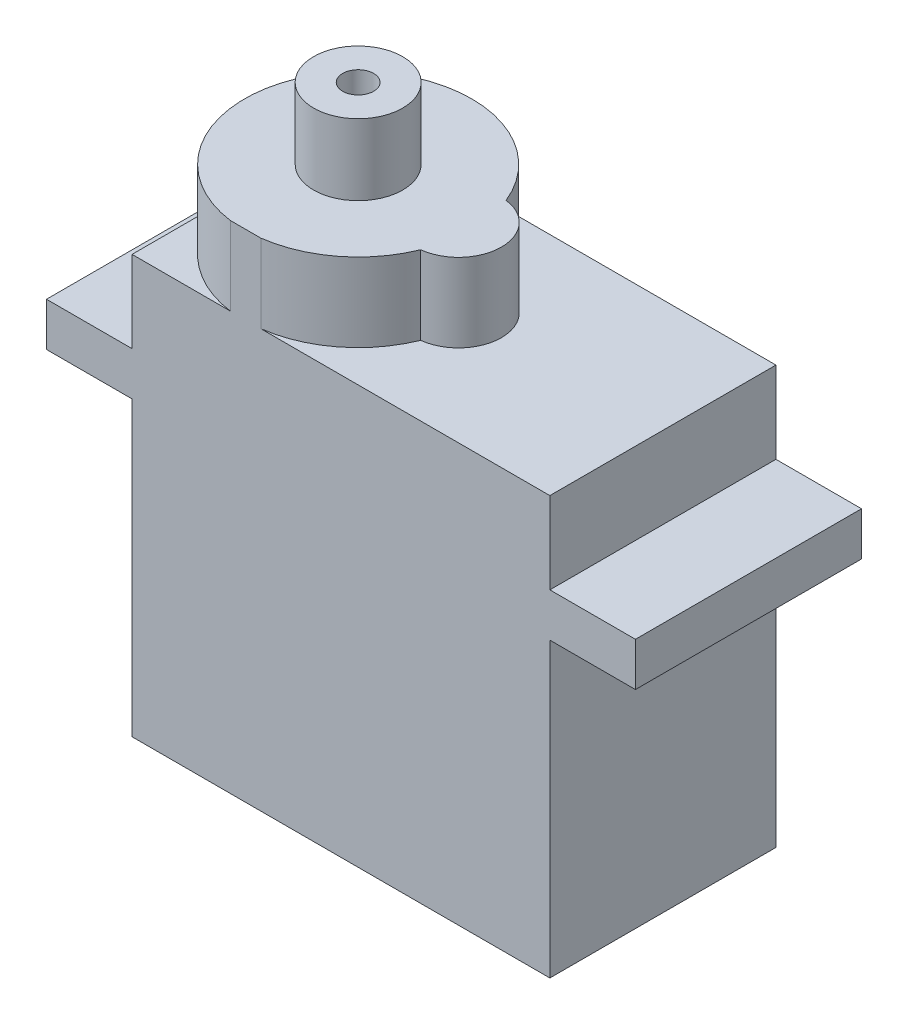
ISO-10303-21;
HEADER;
FILE_DESCRIPTION(('STEP AP214'),'2;1');
FILE_NAME('part.step','',(''),(''),'','','');
FILE_SCHEMA(('AUTOMOTIVE_DESIGN { 1 0 10303 214 1 1 1 1 }'));
ENDSEC;
DATA;
#1=APPLICATION_CONTEXT('core data for automotive mechanical design processes');
#2=APPLICATION_PROTOCOL_DEFINITION('international standard','automotive_design',2000,#1);
#3=PRODUCT_CONTEXT('',#1,'mechanical');
#4=PRODUCT('Part','Part','',(#3));
#5=PRODUCT_RELATED_PRODUCT_CATEGORY('part','',(#4));
#6=PRODUCT_DEFINITION_FORMATION('','',#4);
#7=PRODUCT_DEFINITION_CONTEXT('part definition',#1,'design');
#8=PRODUCT_DEFINITION('design','',#6,#7);
#9=PRODUCT_DEFINITION_SHAPE('','',#8);
#10=(LENGTH_UNIT() NAMED_UNIT(*) SI_UNIT(.MILLI.,.METRE.));
#11=(NAMED_UNIT(*) PLANE_ANGLE_UNIT() SI_UNIT($,.RADIAN.));
#12=(NAMED_UNIT(*) SI_UNIT($,.STERADIAN.) SOLID_ANGLE_UNIT());
#13=UNCERTAINTY_MEASURE_WITH_UNIT(LENGTH_MEASURE(1.E-05),#10,'distance_accuracy_value','');
#14=(GEOMETRIC_REPRESENTATION_CONTEXT(3) GLOBAL_UNCERTAINTY_ASSIGNED_CONTEXT((#13)) GLOBAL_UNIT_ASSIGNED_CONTEXT((#10,
#11,#12)) REPRESENTATION_CONTEXT('',''));
#15=CARTESIAN_POINT('',(0.,0.,0.));
#16=DIRECTION('',(0.,0.,1.));
#17=DIRECTION('',(1.,0.,0.));
#18=AXIS2_PLACEMENT_3D('',#15,#16,#17);
#19=CARTESIAN_POINT('',(-16.7886521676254,19.315529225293,12.1));
#20=DIRECTION('',(0.,-1.,0.));
#21=DIRECTION('',(0.,0.,-1.));
#22=AXIS2_PLACEMENT_3D('',#19,#20,#21);
#23=PLANE('',#22);
#24=CARTESIAN_POINT('',(-10.7113130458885,19.315529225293,6.07733912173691));
#25=DIRECTION('',(0.,1.,0.));
#26=DIRECTION('',(0.,0.,1.));
#27=AXIS2_PLACEMENT_3D('',#24,#25,#26);
#28=CIRCLE('',#27,6.07733912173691);
#29=CARTESIAN_POINT('',(-16.7886521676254,19.315529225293,6.07733912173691));
#30=VERTEX_POINT('',#29);
#31=CARTESIAN_POINT('',(-11.5247051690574,19.315529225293,12.1));
#32=VERTEX_POINT('',#31);
#33=EDGE_CURVE('E45',#30,#32,#28,.T.);
#34=ORIENTED_EDGE('',*,*,#33,.F.);
#35=DIRECTION('',(0.,0.,-1.));
#36=VECTOR('',#35,1.);
#37=CARTESIAN_POINT('',(-16.7886521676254,19.315529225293,12.1));
#38=LINE('',#37,#36);
#39=CARTESIAN_POINT('',(-16.7886521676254,19.315529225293,12.1));
#40=VERTEX_POINT('',#39);
#41=EDGE_CURVE('E265',#40,#30,#38,.T.);
#42=ORIENTED_EDGE('',*,*,#41,.F.);
#43=DIRECTION('',(-1.,0.,0.));
#44=VECTOR('',#43,1.);
#45=CARTESIAN_POINT('',(-16.7886521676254,19.315529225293,12.1));
#46=LINE('',#45,#44);
#47=EDGE_CURVE('E61',#32,#40,#46,.T.);
#48=ORIENTED_EDGE('',*,*,#47,.F.);
#49=EDGE_LOOP('',(#34,#42,#48));
#50=FACE_BOUND('',#49,.T.);
#51=ADVANCED_FACE('F36',(#50),#23,.F.);
#52=CARTESIAN_POINT('',(-10.7113130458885,19.315529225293,0.));
#53=VERTEX_POINT('',#52);
#54=EDGE_CURVE('E277',#53,#30,#28,.T.);
#55=ORIENTED_EDGE('',*,*,#54,.F.);
#56=DIRECTION('',(-1.,0.,0.));
#57=VECTOR('',#56,1.);
#58=CARTESIAN_POINT('',(-16.7886521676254,19.315529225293,0.));
#59=LINE('',#58,#57);
#60=CARTESIAN_POINT('',(-16.7886521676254,19.315529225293,0.));
#61=VERTEX_POINT('',#60);
#62=EDGE_CURVE('E262',#53,#61,#59,.T.);
#63=ORIENTED_EDGE('',*,*,#62,.T.);
#64=EDGE_CURVE('E254',#30,#61,#38,.T.);
#65=ORIENTED_EDGE('',*,*,#64,.F.);
#66=EDGE_LOOP('',(#55,#63,#65));
#67=FACE_BOUND('',#66,.T.);
#68=ADVANCED_FACE('F318',(#67),#23,.F.);
#69=CARTESIAN_POINT('',(-16.7886521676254,19.315529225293,12.1));
#70=DIRECTION('',(1.,0.,0.));
#71=DIRECTION('',(0.,1.,0.));
#72=AXIS2_PLACEMENT_3D('',#69,#70,#71);
#73=PLANE('',#72);
#74=DIRECTION('',(0.,0.,-1.));
#75=VECTOR('',#74,1.);
#76=CARTESIAN_POINT('',(-16.7886521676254,14.945529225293,0.));
#77=LINE('',#76,#75);
#78=CARTESIAN_POINT('',(-16.7886521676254,14.945529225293,12.1));
#79=VERTEX_POINT('',#78);
#80=CARTESIAN_POINT('',(-16.7886521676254,14.945529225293,0.));
#81=VERTEX_POINT('',#80);
#82=EDGE_CURVE('E187',#79,#81,#77,.T.);
#83=ORIENTED_EDGE('',*,*,#82,.F.);
#84=DIRECTION('',(0.,-1.,0.));
#85=VECTOR('',#84,1.);
#86=CARTESIAN_POINT('',(-16.7886521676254,19.315529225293,12.1));
#87=LINE('',#86,#85);
#88=EDGE_CURVE('E244',#40,#79,#87,.T.);
#89=ORIENTED_EDGE('',*,*,#88,.F.);
#90=ORIENTED_EDGE('',*,*,#41,.T.);
#91=ORIENTED_EDGE('',*,*,#64,.T.);
#92=DIRECTION('',(0.,-1.,0.));
#93=VECTOR('',#92,1.);
#94=CARTESIAN_POINT('',(-16.7886521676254,19.315529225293,0.));
#95=LINE('',#94,#93);
#96=EDGE_CURVE('E255',#61,#81,#95,.T.);
#97=ORIENTED_EDGE('',*,*,#96,.T.);
#98=EDGE_LOOP('',(#83,#89,#90,#91,#97));
#99=FACE_BOUND('',#98,.T.);
#100=ADVANCED_FACE('F38',(#99),#73,.F.);
#101=DIRECTION('',(0.,0.,1.));
#102=VECTOR('',#101,1.);
#103=CARTESIAN_POINT('',(-16.7886521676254,12.615529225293,0.));
#104=LINE('',#103,#102);
#105=CARTESIAN_POINT('',(-16.7886521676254,12.615529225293,0.));
#106=VERTEX_POINT('',#105);
#107=CARTESIAN_POINT('',(-16.7886521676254,12.615529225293,12.1));
#108=VERTEX_POINT('',#107);
#109=EDGE_CURVE('E184',#106,#108,#104,.T.);
#110=ORIENTED_EDGE('',*,*,#109,.F.);
#111=CARTESIAN_POINT('',(-16.7886521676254,-3.04447077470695,0.));
#112=VERTEX_POINT('',#111);
#113=EDGE_CURVE('E243',#106,#112,#95,.T.);
#114=ORIENTED_EDGE('',*,*,#113,.T.);
#115=DIRECTION('',(0.,0.,-1.));
#116=VECTOR('',#115,1.);
#117=CARTESIAN_POINT('',(-16.7886521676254,-3.04447077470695,12.1));
#118=LINE('',#117,#116);
#119=CARTESIAN_POINT('',(-16.7886521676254,-3.04447077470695,12.1));
#120=VERTEX_POINT('',#119);
#121=EDGE_CURVE('E40',#120,#112,#118,.T.);
#122=ORIENTED_EDGE('',*,*,#121,.F.);
#123=EDGE_CURVE('E247',#108,#120,#87,.T.);
#124=ORIENTED_EDGE('',*,*,#123,.F.);
#125=EDGE_LOOP('',(#110,#114,#122,#124));
#126=FACE_BOUND('',#125,.T.);
#127=ADVANCED_FACE('F341',(#126),#73,.F.);
#128=CARTESIAN_POINT('',(5.57134783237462,19.315529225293,12.1));
#129=DIRECTION('',(-1.,0.,0.));
#130=DIRECTION('',(0.,-1.,0.));
#131=AXIS2_PLACEMENT_3D('',#128,#129,#130);
#132=PLANE('',#131);
#133=DIRECTION('',(0.,0.,1.));
#134=VECTOR('',#133,1.);
#135=CARTESIAN_POINT('',(5.57134783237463,14.945529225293,12.1));
#136=LINE('',#135,#134);
#137=CARTESIAN_POINT('',(5.57134783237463,14.945529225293,0.));
#138=VERTEX_POINT('',#137);
#139=CARTESIAN_POINT('',(5.57134783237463,14.945529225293,12.1));
#140=VERTEX_POINT('',#139);
#141=EDGE_CURVE('E221',#138,#140,#136,.T.);
#142=ORIENTED_EDGE('',*,*,#141,.F.);
#143=DIRECTION('',(0.,1.,0.));
#144=VECTOR('',#143,1.);
#145=CARTESIAN_POINT('',(5.57134783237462,19.315529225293,0.));
#146=LINE('',#145,#144);
#147=CARTESIAN_POINT('',(5.57134783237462,19.315529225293,0.));
#148=VERTEX_POINT('',#147);
#149=EDGE_CURVE('E259',#138,#148,#146,.T.);
#150=ORIENTED_EDGE('',*,*,#149,.T.);
#151=DIRECTION('',(0.,0.,-1.));
#152=VECTOR('',#151,1.);
#153=CARTESIAN_POINT('',(5.57134783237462,19.315529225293,12.1));
#154=LINE('',#153,#152);
#155=CARTESIAN_POINT('',(5.57134783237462,19.315529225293,12.1));
#156=VERTEX_POINT('',#155);
#157=EDGE_CURVE('E268',#156,#148,#154,.T.);
#158=ORIENTED_EDGE('',*,*,#157,.F.);
#159=DIRECTION('',(0.,1.,0.));
#160=VECTOR('',#159,1.);
#161=CARTESIAN_POINT('',(5.57134783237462,19.315529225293,12.1));
#162=LINE('',#161,#160);
#163=EDGE_CURVE('E249',#140,#156,#162,.T.);
#164=ORIENTED_EDGE('',*,*,#163,.F.);
#165=EDGE_LOOP('',(#142,#150,#158,#164));
#166=FACE_BOUND('',#165,.T.);
#167=ADVANCED_FACE('F339',(#166),#132,.F.);
#168=DIRECTION('',(0.,0.,-1.));
#169=VECTOR('',#168,1.);
#170=CARTESIAN_POINT('',(5.57134783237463,12.615529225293,12.1));
#171=LINE('',#170,#169);
#172=CARTESIAN_POINT('',(5.57134783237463,12.6155292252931,12.1));
#173=VERTEX_POINT('',#172);
#174=CARTESIAN_POINT('',(5.57134783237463,12.615529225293,0.));
#175=VERTEX_POINT('',#174);
#176=EDGE_CURVE('E216',#173,#175,#171,.T.);
#177=ORIENTED_EDGE('',*,*,#176,.F.);
#178=CARTESIAN_POINT('',(5.57134783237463,-3.04447077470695,12.1));
#179=VERTEX_POINT('',#178);
#180=EDGE_CURVE('E250',#179,#173,#162,.T.);
#181=ORIENTED_EDGE('',*,*,#180,.F.);
#182=DIRECTION('',(0.,0.,-1.));
#183=VECTOR('',#182,1.);
#184=CARTESIAN_POINT('',(5.57134783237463,-3.04447077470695,12.1));
#185=LINE('',#184,#183);
#186=CARTESIAN_POINT('',(5.57134783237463,-3.04447077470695,0.));
#187=VERTEX_POINT('',#186);
#188=EDGE_CURVE('E270',#179,#187,#185,.T.);
#189=ORIENTED_EDGE('',*,*,#188,.T.);
#190=EDGE_CURVE('E260',#187,#175,#146,.T.);
#191=ORIENTED_EDGE('',*,*,#190,.T.);
#192=EDGE_LOOP('',(#177,#181,#189,#191));
#193=FACE_BOUND('',#192,.T.);
#194=ADVANCED_FACE('F335',(#193),#132,.F.);
#195=CARTESIAN_POINT('',(-16.7886521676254,-3.04447077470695,12.1));
#196=DIRECTION('',(0.,1.,0.));
#197=DIRECTION('',(0.,0.,1.));
#198=AXIS2_PLACEMENT_3D('',#195,#196,#197);
#199=PLANE('',#198);
#200=DIRECTION('',(1.,0.,0.));
#201=VECTOR('',#200,1.);
#202=CARTESIAN_POINT('',(-16.7886521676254,-3.04447077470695,0.));
#203=LINE('',#202,#201);
#204=EDGE_CURVE('E257',#112,#187,#203,.T.);
#205=ORIENTED_EDGE('',*,*,#204,.T.);
#206=ORIENTED_EDGE('',*,*,#188,.F.);
#207=DIRECTION('',(1.,0.,0.));
#208=VECTOR('',#207,1.);
#209=CARTESIAN_POINT('',(-16.7886521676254,-3.04447077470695,12.1));
#210=LINE('',#209,#208);
#211=EDGE_CURVE('E246',#120,#179,#210,.T.);
#212=ORIENTED_EDGE('',*,*,#211,.F.);
#213=ORIENTED_EDGE('',*,*,#121,.T.);
#214=EDGE_LOOP('',(#205,#206,#212,#213));
#215=FACE_BOUND('',#214,.T.);
#216=ADVANCED_FACE('F329',(#215),#199,.F.);
#217=CARTESIAN_POINT('',(-5.0799288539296,19.315529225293,3.7922651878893));
#218=VERTEX_POINT('',#217);
#219=EDGE_CURVE('E53',#218,#53,#28,.T.);
#220=ORIENTED_EDGE('',*,*,#219,.F.);
#221=CARTESIAN_POINT('',(-5.34153374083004,19.315529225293,6.07733912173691));
#222=DIRECTION('',(0.,1.,0.));
#223=DIRECTION('',(0.,0.,1.));
#224=AXIS2_PLACEMENT_3D('',#221,#222,#223);
#225=CIRCLE('',#224,2.3);
#226=CARTESIAN_POINT('',(-5.0799288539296,19.315529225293,8.36241305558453));
#227=VERTEX_POINT('',#226);
#228=EDGE_CURVE('E287',#227,#218,#225,.T.);
#229=ORIENTED_EDGE('',*,*,#228,.F.);
#230=CARTESIAN_POINT('',(-9.89792092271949,19.315529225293,12.1));
#231=VERTEX_POINT('',#230);
#232=EDGE_CURVE('E284',#231,#227,#28,.T.);
#233=ORIENTED_EDGE('',*,*,#232,.F.);
#234=EDGE_CURVE('E183',#156,#231,#46,.T.);
#235=ORIENTED_EDGE('',*,*,#234,.F.);
#236=ORIENTED_EDGE('',*,*,#157,.T.);
#237=EDGE_CURVE('E263',#148,#53,#59,.T.);
#238=ORIENTED_EDGE('',*,*,#237,.T.);
#239=EDGE_LOOP('',(#220,#229,#233,#235,#236,#238));
#240=FACE_BOUND('',#239,.T.);
#241=ADVANCED_FACE('F305',(#240),#23,.F.);
#242=CARTESIAN_POINT('',(0.,0.,12.1));
#243=DIRECTION('',(0.,0.,1.));
#244=DIRECTION('',(1.,0.,0.));
#245=AXIS2_PLACEMENT_3D('',#242,#243,#244);
#246=PLANE('',#245);
#247=ORIENTED_EDGE('',*,*,#88,.T.);
#248=DIRECTION('',(1.,0.,0.));
#249=VECTOR('',#248,1.);
#250=CARTESIAN_POINT('',(-21.3686521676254,14.945529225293,12.1));
#251=LINE('',#250,#249);
#252=CARTESIAN_POINT('',(-21.3686521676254,14.945529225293,12.1));
#253=VERTEX_POINT('',#252);
#254=EDGE_CURVE('E207',#253,#79,#251,.T.);
#255=ORIENTED_EDGE('',*,*,#254,.F.);
#256=DIRECTION('',(0.,1.,0.));
#257=VECTOR('',#256,1.);
#258=CARTESIAN_POINT('',(-21.3686521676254,14.945529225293,12.1));
#259=LINE('',#258,#257);
#260=CARTESIAN_POINT('',(-21.3686521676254,12.615529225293,12.1));
#261=VERTEX_POINT('',#260);
#262=EDGE_CURVE('E198',#261,#253,#259,.T.);
#263=ORIENTED_EDGE('',*,*,#262,.F.);
#264=DIRECTION('',(1.,0.,0.));
#265=VECTOR('',#264,1.);
#266=CARTESIAN_POINT('',(-21.3686521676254,12.615529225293,12.1));
#267=LINE('',#266,#265);
#268=EDGE_CURVE('E210',#261,#108,#267,.T.);
#269=ORIENTED_EDGE('',*,*,#268,.T.);
#270=ORIENTED_EDGE('',*,*,#123,.T.);
#271=ORIENTED_EDGE('',*,*,#211,.T.);
#272=ORIENTED_EDGE('',*,*,#180,.T.);
#273=DIRECTION('',(-1.,0.,0.));
#274=VECTOR('',#273,1.);
#275=CARTESIAN_POINT('',(10.1513478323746,12.615529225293,12.1));
#276=LINE('',#275,#274);
#277=CARTESIAN_POINT('',(10.1513478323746,12.615529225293,12.1));
#278=VERTEX_POINT('',#277);
#279=EDGE_CURVE('E240',#278,#173,#276,.T.);
#280=ORIENTED_EDGE('',*,*,#279,.F.);
#281=DIRECTION('',(0.,-1.,0.));
#282=VECTOR('',#281,1.);
#283=CARTESIAN_POINT('',(10.1513478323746,14.945529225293,12.1));
#284=LINE('',#283,#282);
#285=CARTESIAN_POINT('',(10.1513478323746,14.945529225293,12.1));
#286=VERTEX_POINT('',#285);
#287=EDGE_CURVE('E217',#286,#278,#284,.T.);
#288=ORIENTED_EDGE('',*,*,#287,.F.);
#289=DIRECTION('',(-1.,0.,0.));
#290=VECTOR('',#289,1.);
#291=CARTESIAN_POINT('',(10.1513478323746,14.945529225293,12.1));
#292=LINE('',#291,#290);
#293=EDGE_CURVE('E227',#286,#140,#292,.T.);
#294=ORIENTED_EDGE('',*,*,#293,.T.);
#295=ORIENTED_EDGE('',*,*,#163,.T.);
#296=ORIENTED_EDGE('',*,*,#234,.T.);
#297=DIRECTION('',(0.,-1.,0.));
#298=VECTOR('',#297,1.);
#299=CARTESIAN_POINT('',(-9.8979209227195,23.515529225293,12.1));
#300=LINE('',#299,#298);
#301=CARTESIAN_POINT('',(-9.8979209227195,23.515529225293,12.1));
#302=VERTEX_POINT('',#301);
#303=EDGE_CURVE('E163',#302,#231,#300,.T.);
#304=ORIENTED_EDGE('',*,*,#303,.F.);
#305=DIRECTION('',(1.,0.,0.));
#306=VECTOR('',#305,1.);
#307=CARTESIAN_POINT('',(0.,23.515529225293,12.1));
#308=LINE('',#307,#306);
#309=CARTESIAN_POINT('',(-11.5247051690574,23.515529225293,12.1));
#310=VERTEX_POINT('',#309);
#311=EDGE_CURVE('E169',#310,#302,#308,.T.);
#312=ORIENTED_EDGE('',*,*,#311,.F.);
#313=DIRECTION('',(0.,-1.,0.));
#314=VECTOR('',#313,1.);
#315=CARTESIAN_POINT('',(-11.5247051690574,23.515529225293,12.1));
#316=LINE('',#315,#314);
#317=EDGE_CURVE('E300',#310,#32,#316,.T.);
#318=ORIENTED_EDGE('',*,*,#317,.T.);
#319=ORIENTED_EDGE('',*,*,#47,.T.);
#320=EDGE_LOOP('',(#247,#255,#263,#269,#270,#271,#272,#280,#288,#294,#295,#296,#304,#312,#318,#319));
#321=FACE_BOUND('',#320,.T.);
#322=ADVANCED_FACE('F181',(#321),#246,.T.);
#323=CARTESIAN_POINT('',(0.,0.,0.));
#324=DIRECTION('',(0.,0.,1.));
#325=DIRECTION('',(1.,0.,0.));
#326=AXIS2_PLACEMENT_3D('',#323,#324,#325);
#327=PLANE('',#326);
#328=ORIENTED_EDGE('',*,*,#96,.F.);
#329=ORIENTED_EDGE('',*,*,#62,.F.);
#330=ORIENTED_EDGE('',*,*,#237,.F.);
#331=ORIENTED_EDGE('',*,*,#149,.F.);
#332=DIRECTION('',(-1.,0.,0.));
#333=VECTOR('',#332,1.);
#334=CARTESIAN_POINT('',(10.1513478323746,14.945529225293,0.));
#335=LINE('',#334,#333);
#336=CARTESIAN_POINT('',(10.1513478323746,14.945529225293,0.));
#337=VERTEX_POINT('',#336);
#338=EDGE_CURVE('E234',#337,#138,#335,.T.);
#339=ORIENTED_EDGE('',*,*,#338,.F.);
#340=DIRECTION('',(0.,1.,0.));
#341=VECTOR('',#340,1.);
#342=CARTESIAN_POINT('',(10.1513478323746,14.945529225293,0.));
#343=LINE('',#342,#341);
#344=CARTESIAN_POINT('',(10.1513478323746,12.6155292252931,0.));
#345=VERTEX_POINT('',#344);
#346=EDGE_CURVE('E223',#345,#337,#343,.T.);
#347=ORIENTED_EDGE('',*,*,#346,.F.);
#348=DIRECTION('',(-1.,0.,0.));
#349=VECTOR('',#348,1.);
#350=CARTESIAN_POINT('',(10.1513478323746,12.6155292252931,0.));
#351=LINE('',#350,#349);
#352=EDGE_CURVE('E237',#345,#175,#351,.T.);
#353=ORIENTED_EDGE('',*,*,#352,.T.);
#354=ORIENTED_EDGE('',*,*,#190,.F.);
#355=ORIENTED_EDGE('',*,*,#204,.F.);
#356=ORIENTED_EDGE('',*,*,#113,.F.);
#357=DIRECTION('',(1.,0.,0.));
#358=VECTOR('',#357,1.);
#359=CARTESIAN_POINT('',(-21.3686521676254,12.615529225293,0.));
#360=LINE('',#359,#358);
#361=CARTESIAN_POINT('',(-21.3686521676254,12.615529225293,0.));
#362=VERTEX_POINT('',#361);
#363=EDGE_CURVE('E213',#362,#106,#360,.T.);
#364=ORIENTED_EDGE('',*,*,#363,.F.);
#365=DIRECTION('',(0.,-1.,0.));
#366=VECTOR('',#365,1.);
#367=CARTESIAN_POINT('',(-21.3686521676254,14.945529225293,0.));
#368=LINE('',#367,#366);
#369=CARTESIAN_POINT('',(-21.3686521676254,14.945529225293,0.));
#370=VERTEX_POINT('',#369);
#371=EDGE_CURVE('E193',#370,#362,#368,.T.);
#372=ORIENTED_EDGE('',*,*,#371,.F.);
#373=DIRECTION('',(1.,0.,0.));
#374=VECTOR('',#373,1.);
#375=CARTESIAN_POINT('',(-21.3686521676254,14.945529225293,0.));
#376=LINE('',#375,#374);
#377=EDGE_CURVE('E201',#370,#81,#376,.T.);
#378=ORIENTED_EDGE('',*,*,#377,.T.);
#379=EDGE_LOOP('',(#328,#329,#330,#331,#339,#347,#353,#354,#355,#356,#364,#372,#378));
#380=FACE_BOUND('',#379,.T.);
#381=ADVANCED_FACE('F313',(#380),#327,.F.);
#382=CARTESIAN_POINT('',(10.1513478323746,12.615529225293,12.1));
#383=DIRECTION('',(0.,1.,0.));
#384=DIRECTION('',(-1.,0.,0.));
#385=AXIS2_PLACEMENT_3D('',#382,#383,#384);
#386=PLANE('',#385);
#387=ORIENTED_EDGE('',*,*,#176,.T.);
#388=ORIENTED_EDGE('',*,*,#352,.F.);
#389=DIRECTION('',(0.,0.,-1.));
#390=VECTOR('',#389,1.);
#391=CARTESIAN_POINT('',(10.1513478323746,12.615529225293,12.1));
#392=LINE('',#391,#390);
#393=EDGE_CURVE('E220',#278,#345,#392,.T.);
#394=ORIENTED_EDGE('',*,*,#393,.F.);
#395=ORIENTED_EDGE('',*,*,#279,.T.);
#396=EDGE_LOOP('',(#387,#388,#394,#395));
#397=FACE_BOUND('',#396,.T.);
#398=ADVANCED_FACE('F358',(#397),#386,.F.);
#399=CARTESIAN_POINT('',(10.1513478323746,14.945529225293,12.1));
#400=DIRECTION('',(0.,-1.,0.));
#401=DIRECTION('',(1.,0.,0.));
#402=AXIS2_PLACEMENT_3D('',#399,#400,#401);
#403=PLANE('',#402);
#404=ORIENTED_EDGE('',*,*,#141,.T.);
#405=ORIENTED_EDGE('',*,*,#293,.F.);
#406=DIRECTION('',(0.,0.,1.));
#407=VECTOR('',#406,1.);
#408=CARTESIAN_POINT('',(10.1513478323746,14.945529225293,12.1));
#409=LINE('',#408,#407);
#410=EDGE_CURVE('E225',#337,#286,#409,.T.);
#411=ORIENTED_EDGE('',*,*,#410,.F.);
#412=ORIENTED_EDGE('',*,*,#338,.T.);
#413=EDGE_LOOP('',(#404,#405,#411,#412));
#414=FACE_BOUND('',#413,.T.);
#415=ADVANCED_FACE('F348',(#414),#403,.F.);
#416=CARTESIAN_POINT('',(10.1513478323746,0.,0.));
#417=DIRECTION('',(1.,0.,0.));
#418=DIRECTION('',(0.,0.,-1.));
#419=AXIS2_PLACEMENT_3D('',#416,#417,#418);
#420=PLANE('',#419);
#421=ORIENTED_EDGE('',*,*,#287,.T.);
#422=ORIENTED_EDGE('',*,*,#393,.T.);
#423=ORIENTED_EDGE('',*,*,#346,.T.);
#424=ORIENTED_EDGE('',*,*,#410,.T.);
#425=EDGE_LOOP('',(#421,#422,#423,#424));
#426=FACE_BOUND('',#425,.T.);
#427=ADVANCED_FACE('F353',(#426),#420,.T.);
#428=CARTESIAN_POINT('',(-21.3686521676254,12.615529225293,0.));
#429=DIRECTION('',(0.,1.,0.));
#430=DIRECTION('',(-1.,0.,0.));
#431=AXIS2_PLACEMENT_3D('',#428,#429,#430);
#432=PLANE('',#431);
#433=ORIENTED_EDGE('',*,*,#109,.T.);
#434=ORIENTED_EDGE('',*,*,#268,.F.);
#435=DIRECTION('',(0.,0.,1.));
#436=VECTOR('',#435,1.);
#437=CARTESIAN_POINT('',(-21.3686521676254,12.615529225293,0.));
#438=LINE('',#437,#436);
#439=EDGE_CURVE('E196',#362,#261,#438,.T.);
#440=ORIENTED_EDGE('',*,*,#439,.F.);
#441=ORIENTED_EDGE('',*,*,#363,.T.);
#442=EDGE_LOOP('',(#433,#434,#440,#441));
#443=FACE_BOUND('',#442,.T.);
#444=ADVANCED_FACE('F363',(#443),#432,.F.);
#445=CARTESIAN_POINT('',(-21.3686521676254,14.945529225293,0.));
#446=DIRECTION('',(0.,-1.,0.));
#447=DIRECTION('',(1.,0.,0.));
#448=AXIS2_PLACEMENT_3D('',#445,#446,#447);
#449=PLANE('',#448);
#450=ORIENTED_EDGE('',*,*,#82,.T.);
#451=ORIENTED_EDGE('',*,*,#377,.F.);
#452=DIRECTION('',(0.,0.,-1.));
#453=VECTOR('',#452,1.);
#454=CARTESIAN_POINT('',(-21.3686521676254,14.945529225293,0.));
#455=LINE('',#454,#453);
#456=EDGE_CURVE('E200',#253,#370,#455,.T.);
#457=ORIENTED_EDGE('',*,*,#456,.F.);
#458=ORIENTED_EDGE('',*,*,#254,.T.);
#459=EDGE_LOOP('',(#450,#451,#457,#458));
#460=FACE_BOUND('',#459,.T.);
#461=ADVANCED_FACE('F371',(#460),#449,.F.);
#462=CARTESIAN_POINT('',(-21.3686521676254,0.,0.));
#463=DIRECTION('',(-1.,0.,0.));
#464=DIRECTION('',(0.,0.,1.));
#465=AXIS2_PLACEMENT_3D('',#462,#463,#464);
#466=PLANE('',#465);
#467=ORIENTED_EDGE('',*,*,#371,.T.);
#468=ORIENTED_EDGE('',*,*,#439,.T.);
#469=ORIENTED_EDGE('',*,*,#262,.T.);
#470=ORIENTED_EDGE('',*,*,#456,.T.);
#471=EDGE_LOOP('',(#467,#468,#469,#470));
#472=FACE_BOUND('',#471,.T.);
#473=ADVANCED_FACE('F367',(#472),#466,.T.);
#474=CARTESIAN_POINT('',(-10.7113130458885,23.515529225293,6.07733912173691));
#475=DIRECTION('',(0.,-1.,0.));
#476=DIRECTION('',(0.,0.,-1.));
#477=AXIS2_PLACEMENT_3D('',#474,#475,#476);
#478=CYLINDRICAL_SURFACE('',#477,6.07733912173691);
#479=ORIENTED_EDGE('',*,*,#232,.T.);
#480=DIRECTION('',(0.,-1.,0.));
#481=VECTOR('',#480,1.);
#482=CARTESIAN_POINT('',(-5.0799288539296,23.515529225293,8.36241305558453));
#483=LINE('',#482,#481);
#484=CARTESIAN_POINT('',(-5.0799288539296,23.515529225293,8.36241305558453));
#485=VERTEX_POINT('',#484);
#486=EDGE_CURVE('E165',#485,#227,#483,.T.);
#487=ORIENTED_EDGE('',*,*,#486,.F.);
#488=CARTESIAN_POINT('',(-10.7113130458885,23.515529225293,6.07733912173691));
#489=DIRECTION('',(0.,1.,0.));
#490=DIRECTION('',(0.,0.,1.));
#491=AXIS2_PLACEMENT_3D('',#488,#489,#490);
#492=CIRCLE('',#491,6.07733912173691);
#493=EDGE_CURVE('E158',#302,#485,#492,.T.);
#494=ORIENTED_EDGE('',*,*,#493,.F.);
#495=ORIENTED_EDGE('',*,*,#303,.T.);
#496=EDGE_LOOP('',(#479,#487,#494,#495));
#497=FACE_BOUND('',#496,.T.);
#498=ADVANCED_FACE('F161',(#497),#478,.T.);
#499=CARTESIAN_POINT('',(-5.34153374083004,23.515529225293,6.07733912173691));
#500=DIRECTION('',(0.,-1.,0.));
#501=DIRECTION('',(0.,0.,-1.));
#502=AXIS2_PLACEMENT_3D('',#499,#500,#501);
#503=CYLINDRICAL_SURFACE('',#502,2.3);
#504=ORIENTED_EDGE('',*,*,#228,.T.);
#505=DIRECTION('',(0.,-1.,0.));
#506=VECTOR('',#505,1.);
#507=CARTESIAN_POINT('',(-5.0799288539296,23.515529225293,3.7922651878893));
#508=LINE('',#507,#506);
#509=CARTESIAN_POINT('',(-5.0799288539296,23.515529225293,3.7922651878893));
#510=VERTEX_POINT('',#509);
#511=EDGE_CURVE('E189',#510,#218,#508,.T.);
#512=ORIENTED_EDGE('',*,*,#511,.F.);
#513=CARTESIAN_POINT('',(-5.34153374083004,23.515529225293,6.07733912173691));
#514=DIRECTION('',(0.,1.,0.));
#515=DIRECTION('',(0.,0.,1.));
#516=AXIS2_PLACEMENT_3D('',#513,#514,#515);
#517=CIRCLE('',#516,2.3);
#518=EDGE_CURVE('E168',#485,#510,#517,.T.);
#519=ORIENTED_EDGE('',*,*,#518,.F.);
#520=ORIENTED_EDGE('',*,*,#486,.T.);
#521=EDGE_LOOP('',(#504,#512,#519,#520));
#522=FACE_BOUND('',#521,.T.);
#523=ADVANCED_FACE('F304',(#522),#503,.T.);
#524=ORIENTED_EDGE('',*,*,#219,.T.);
#525=ORIENTED_EDGE('',*,*,#54,.T.);
#526=ORIENTED_EDGE('',*,*,#33,.T.);
#527=ORIENTED_EDGE('',*,*,#317,.F.);
#528=EDGE_CURVE('E171',#510,#310,#492,.T.);
#529=ORIENTED_EDGE('',*,*,#528,.F.);
#530=ORIENTED_EDGE('',*,*,#511,.T.);
#531=EDGE_LOOP('',(#524,#525,#526,#527,#529,#530));
#532=FACE_BOUND('',#531,.T.);
#533=ADVANCED_FACE('F302',(#532),#478,.T.);
#534=CARTESIAN_POINT('',(0.,23.515529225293,0.));
#535=DIRECTION('',(0.,1.,0.));
#536=DIRECTION('',(0.,0.,1.));
#537=AXIS2_PLACEMENT_3D('',#534,#535,#536);
#538=PLANE('',#537);
#539=CARTESIAN_POINT('',(-10.7113130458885,23.515529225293,6.07733912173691));
#540=DIRECTION('',(0.,1.,0.));
#541=DIRECTION('',(0.,0.,1.));
#542=AXIS2_PLACEMENT_3D('',#539,#540,#541);
#543=CIRCLE('',#542,2.385);
#544=CARTESIAN_POINT('',(-10.7113130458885,23.515529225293,3.69233912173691));
#545=VERTEX_POINT('',#544);
#546=EDGE_CURVE('E11',#545,#545,#543,.T.);
#547=ORIENTED_EDGE('',*,*,#546,.F.);
#548=EDGE_LOOP('',(#547));
#549=FACE_BOUND('',#548,.T.);
#550=ORIENTED_EDGE('',*,*,#311,.T.);
#551=ORIENTED_EDGE('',*,*,#493,.T.);
#552=ORIENTED_EDGE('',*,*,#518,.T.);
#553=ORIENTED_EDGE('',*,*,#528,.T.);
#554=EDGE_LOOP('',(#550,#551,#552,#553));
#555=FACE_BOUND('',#554,.T.);
#556=ADVANCED_FACE('F173',(#549,#555),#538,.T.);
#557=CARTESIAN_POINT('',(-10.7113130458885,27.315529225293,6.07733912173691));
#558=DIRECTION('',(0.,-1.,0.));
#559=DIRECTION('',(0.,0.,-1.));
#560=AXIS2_PLACEMENT_3D('',#557,#558,#559);
#561=CYLINDRICAL_SURFACE('',#560,2.385);
#562=CARTESIAN_POINT('',(-10.7113130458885,27.315529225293,6.07733912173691));
#563=DIRECTION('',(0.,1.,0.));
#564=DIRECTION('',(0.,0.,1.));
#565=AXIS2_PLACEMENT_3D('',#562,#563,#564);
#566=CIRCLE('',#565,2.385);
#567=CARTESIAN_POINT('',(-10.7113130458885,27.315529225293,3.69233912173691));
#568=VERTEX_POINT('',#567);
#569=EDGE_CURVE('E289',#568,#568,#566,.T.);
#570=CARTESIAN_POINT('',(-10.7113130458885,27.315529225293,3.69233912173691));
#571=CARTESIAN_POINT('',(-10.7113130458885,27.2759458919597,3.69233912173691));
#572=CARTESIAN_POINT('',(-10.7113130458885,27.2363625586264,3.69233912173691));
#573=CARTESIAN_POINT('',(-10.7113130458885,27.1571958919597,3.69233912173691));
#574=CARTESIAN_POINT('',(-10.7113130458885,27.1176125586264,3.69233912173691));
#575=CARTESIAN_POINT('',(-10.7113130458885,27.0384458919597,3.69233912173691));
#576=CARTESIAN_POINT('',(-10.7113130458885,26.9988625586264,3.69233912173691));
#577=CARTESIAN_POINT('',(-10.7113130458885,26.9196958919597,3.69233912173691));
#578=CARTESIAN_POINT('',(-10.7113130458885,26.8801125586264,3.69233912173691));
#579=CARTESIAN_POINT('',(-10.7113130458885,26.8009458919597,3.69233912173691));
#580=CARTESIAN_POINT('',(-10.7113130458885,26.7613625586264,3.69233912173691));
#581=CARTESIAN_POINT('',(-10.7113130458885,26.6821958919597,3.69233912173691));
#582=CARTESIAN_POINT('',(-10.7113130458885,26.6426125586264,3.69233912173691));
#583=CARTESIAN_POINT('',(-10.7113130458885,26.5634458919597,3.69233912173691));
#584=CARTESIAN_POINT('',(-10.7113130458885,26.5238625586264,3.69233912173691));
#585=CARTESIAN_POINT('',(-10.7113130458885,26.4446958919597,3.69233912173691));
#586=CARTESIAN_POINT('',(-10.7113130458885,26.4051125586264,3.69233912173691));
#587=CARTESIAN_POINT('',(-10.7113130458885,26.3259458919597,3.69233912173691));
#588=CARTESIAN_POINT('',(-10.7113130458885,26.2863625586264,3.69233912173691));
#589=CARTESIAN_POINT('',(-10.7113130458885,26.2071958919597,3.69233912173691));
#590=CARTESIAN_POINT('',(-10.7113130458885,26.1676125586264,3.69233912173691));
#591=CARTESIAN_POINT('',(-10.7113130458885,26.0884458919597,3.69233912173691));
#592=CARTESIAN_POINT('',(-10.7113130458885,26.0488625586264,3.69233912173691));
#593=CARTESIAN_POINT('',(-10.7113130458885,25.9696958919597,3.69233912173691));
#594=CARTESIAN_POINT('',(-10.7113130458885,25.9301125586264,3.69233912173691));
#595=CARTESIAN_POINT('',(-10.7113130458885,25.8509458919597,3.69233912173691));
#596=CARTESIAN_POINT('',(-10.7113130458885,25.8113625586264,3.69233912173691));
#597=CARTESIAN_POINT('',(-10.7113130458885,25.7321958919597,3.69233912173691));
#598=CARTESIAN_POINT('',(-10.7113130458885,25.6926125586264,3.69233912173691));
#599=CARTESIAN_POINT('',(-10.7113130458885,25.6134458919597,3.69233912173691));
#600=CARTESIAN_POINT('',(-10.7113130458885,25.5738625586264,3.69233912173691));
#601=CARTESIAN_POINT('',(-10.7113130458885,25.4946958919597,3.69233912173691));
#602=CARTESIAN_POINT('',(-10.7113130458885,25.4551125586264,3.69233912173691));
#603=CARTESIAN_POINT('',(-10.7113130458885,25.3759458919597,3.69233912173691));
#604=CARTESIAN_POINT('',(-10.7113130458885,25.3363625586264,3.69233912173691));
#605=CARTESIAN_POINT('',(-10.7113130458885,25.2571958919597,3.69233912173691));
#606=CARTESIAN_POINT('',(-10.7113130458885,25.2176125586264,3.69233912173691));
#607=CARTESIAN_POINT('',(-10.7113130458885,25.1384458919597,3.69233912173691));
#608=CARTESIAN_POINT('',(-10.7113130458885,25.0988625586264,3.69233912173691));
#609=CARTESIAN_POINT('',(-10.7113130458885,25.0196958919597,3.69233912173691));
#610=CARTESIAN_POINT('',(-10.7113130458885,24.9801125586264,3.69233912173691));
#611=CARTESIAN_POINT('',(-10.7113130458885,24.9009458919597,3.69233912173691));
#612=CARTESIAN_POINT('',(-10.7113130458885,24.8613625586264,3.69233912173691));
#613=CARTESIAN_POINT('',(-10.7113130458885,24.7821958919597,3.69233912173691));
#614=CARTESIAN_POINT('',(-10.7113130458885,24.7426125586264,3.69233912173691));
#615=CARTESIAN_POINT('',(-10.7113130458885,24.6634458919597,3.69233912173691));
#616=CARTESIAN_POINT('',(-10.7113130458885,24.6238625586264,3.69233912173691));
#617=CARTESIAN_POINT('',(-10.7113130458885,24.5446958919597,3.69233912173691));
#618=CARTESIAN_POINT('',(-10.7113130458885,24.5051125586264,3.69233912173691));
#619=CARTESIAN_POINT('',(-10.7113130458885,24.4259458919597,3.69233912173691));
#620=CARTESIAN_POINT('',(-10.7113130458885,24.3863625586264,3.69233912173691));
#621=CARTESIAN_POINT('',(-10.7113130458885,24.3071958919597,3.69233912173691));
#622=CARTESIAN_POINT('',(-10.7113130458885,24.2676125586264,3.69233912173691));
#623=CARTESIAN_POINT('',(-10.7113130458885,24.1884458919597,3.69233912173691));
#624=CARTESIAN_POINT('',(-10.7113130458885,24.1488625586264,3.69233912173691));
#625=CARTESIAN_POINT('',(-10.7113130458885,24.0696958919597,3.69233912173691));
#626=CARTESIAN_POINT('',(-10.7113130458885,24.0301125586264,3.69233912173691));
#627=CARTESIAN_POINT('',(-10.7113130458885,23.9509458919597,3.69233912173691));
#628=CARTESIAN_POINT('',(-10.7113130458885,23.9113625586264,3.69233912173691));
#629=CARTESIAN_POINT('',(-10.7113130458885,23.8321958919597,3.69233912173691));
#630=CARTESIAN_POINT('',(-10.7113130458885,23.7926125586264,3.69233912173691));
#631=CARTESIAN_POINT('',(-10.7113130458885,23.7134458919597,3.69233912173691));
#632=CARTESIAN_POINT('',(-10.7113130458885,23.6738625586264,3.69233912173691));
#633=CARTESIAN_POINT('',(-10.7113130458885,23.5946958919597,3.69233912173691));
#634=CARTESIAN_POINT('',(-10.7113130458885,23.5551125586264,3.69233912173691));
#635=CARTESIAN_POINT('',(-10.7113130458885,23.515529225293,3.69233912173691));
#636=B_SPLINE_CURVE_WITH_KNOTS('',3,(#570,#571,#572,#573,#574,#575,#576,#577,#578,#579,#580,
#581,#582,#583,#584,#585,#586,#587,#588,#589,#590,#591,#592,#593,#594,#595,#596,#597,#598,#599,
#600,#601,#602,#603,#604,#605,#606,#607,#608,#609,#610,#611,#612,#613,#614,#615,#616,#617,#618,
#619,#620,#621,#622,#623,#624,#625,#626,#627,#628,#629,#630,#631,#632,#633,#634,#635),
.UNSPECIFIED.,.F.,.F.,(4,2,2,2,2,2,2,2,2,2,2,2,2,2,2,2,2,2,2,2,2,2,2,2,2,2,2,2,2,2,2,2,4),(0.,
0.118750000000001,0.237500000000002,0.356250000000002,0.475000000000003,0.593750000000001,
0.712500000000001,0.831250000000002,0.950000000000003,1.06875,1.1875,1.30625,1.425,1.54375,
1.6625,1.78125,1.9,2.01875,2.1375,2.25625,2.375,2.49375,2.6125,2.73125,2.85,2.96875,3.0875,
3.20625,3.32500000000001,3.44375,3.5625,3.68125,3.8),.UNSPECIFIED.);
#637=EDGE_CURVE('BSEAM483',#568,#545,#636,.T.);
#638=ORIENTED_EDGE('',*,*,#569,.F.);
#639=ORIENTED_EDGE('',*,*,#546,.T.);
#640=ORIENTED_EDGE('',*,*,#637,.T.);
#641=ORIENTED_EDGE('',*,*,#637,.F.);
#642=EDGE_LOOP('',(#638,#640,#639,#641));
#643=FACE_BOUND('',#642,.T.);
#644=ADVANCED_FACE('F483',(#643),#561,.T.);
#645=CARTESIAN_POINT('',(0.,27.315529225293,0.));
#646=DIRECTION('',(0.,1.,0.));
#647=DIRECTION('',(0.,0.,1.));
#648=AXIS2_PLACEMENT_3D('',#645,#646,#647);
#649=PLANE('',#648);
#650=CARTESIAN_POINT('',(-10.7113130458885,27.315529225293,6.07733912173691));
#651=DIRECTION('',(0.,1.,0.));
#652=DIRECTION('',(0.,0.,1.));
#653=AXIS2_PLACEMENT_3D('',#650,#651,#652);
#654=CIRCLE('',#653,0.830000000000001);
#655=CARTESIAN_POINT('',(-10.7113130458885,27.315529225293,6.90733912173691));
#656=VERTEX_POINT('',#655);
#657=EDGE_CURVE('E296',#656,#656,#654,.T.);
#658=ORIENTED_EDGE('',*,*,#657,.F.);
#659=EDGE_LOOP('',(#658));
#660=FACE_BOUND('',#659,.T.);
#661=ORIENTED_EDGE('',*,*,#569,.T.);
#662=EDGE_LOOP('',(#661));
#663=FACE_BOUND('',#662,.T.);
#664=ADVANCED_FACE('F495',(#660,#663),#649,.T.);
#665=CARTESIAN_POINT('',(-10.7113130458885,23.265529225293,6.07733912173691));
#666=DIRECTION('',(0.,1.,0.));
#667=DIRECTION('',(0.,0.,1.));
#668=AXIS2_PLACEMENT_3D('',#665,#666,#667);
#669=CYLINDRICAL_SURFACE('',#668,0.830000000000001);
#670=CARTESIAN_POINT('',(-10.7113130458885,23.265529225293,6.07733912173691));
#671=DIRECTION('',(0.,1.,0.));
#672=DIRECTION('',(0.,0.,1.));
#673=AXIS2_PLACEMENT_3D('',#670,#671,#672);
#674=CIRCLE('',#673,0.830000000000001);
#675=CARTESIAN_POINT('',(-10.7113130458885,23.265529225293,6.90733912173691));
#676=VERTEX_POINT('',#675);
#677=EDGE_CURVE('E291',#676,#676,#674,.T.);
#678=ORIENTED_EDGE('',*,*,#677,.F.);
#679=EDGE_LOOP('',(#678));
#680=FACE_BOUND('',#679,.T.);
#681=ORIENTED_EDGE('',*,*,#657,.T.);
#682=EDGE_LOOP('',(#681));
#683=FACE_BOUND('',#682,.T.);
#684=ADVANCED_FACE('F504',(#680,#683),#669,.F.);
#685=CARTESIAN_POINT('',(0.,23.265529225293,0.));
#686=DIRECTION('',(0.,1.,0.));
#687=DIRECTION('',(0.,0.,1.));
#688=AXIS2_PLACEMENT_3D('',#685,#686,#687);
#689=PLANE('',#688);
#690=ORIENTED_EDGE('',*,*,#677,.T.);
#691=EDGE_LOOP('',(#690));
#692=FACE_BOUND('',#691,.T.);
#693=ADVANCED_FACE('F513',(#692),#689,.T.);
#694=CLOSED_SHELL('',(#51,#68,#100,#127,#167,#194,#216,#241,#322,#381,#398,#415,#427,#444,#461,
#473,#498,#523,#533,#556,#644,#664,#684,#693));
#695=MANIFOLD_SOLID_BREP('B2',#694);
#696=ADVANCED_BREP_SHAPE_REPRESENTATION('',(#18,#695),#14);
#697=SHAPE_DEFINITION_REPRESENTATION(#9,#696);
ENDSEC;
END-ISO-10303-21;
